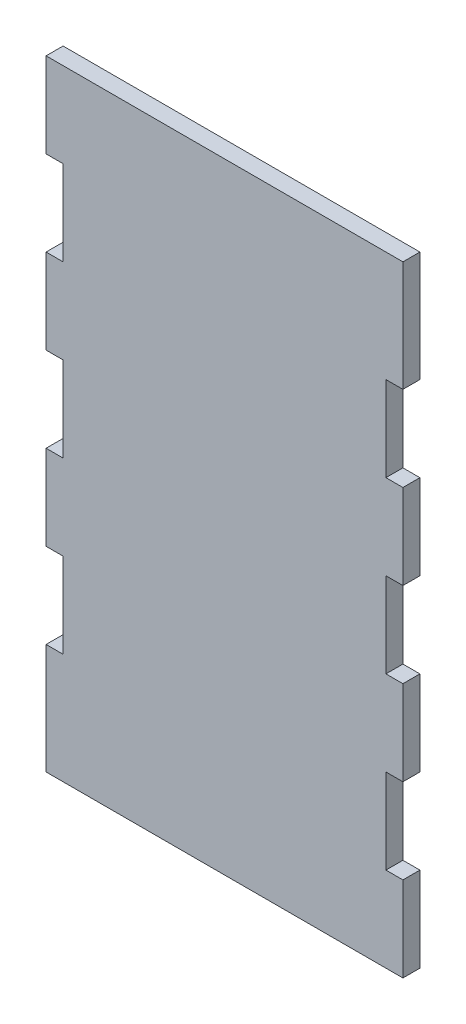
ISO-10303-21;
HEADER;
FILE_DESCRIPTION(('STEP AP214'),'2;1');
FILE_NAME('part.step','',(''),(''),'','','');
FILE_SCHEMA(('AUTOMOTIVE_DESIGN { 1 0 10303 214 1 1 1 1 }'));
ENDSEC;
DATA;
#1=APPLICATION_CONTEXT('core data for automotive mechanical design processes');
#2=APPLICATION_PROTOCOL_DEFINITION('international standard','automotive_design',2000,#1);
#3=PRODUCT_CONTEXT('',#1,'mechanical');
#4=PRODUCT('Part','Part','',(#3));
#5=PRODUCT_RELATED_PRODUCT_CATEGORY('part','',(#4));
#6=PRODUCT_DEFINITION_FORMATION('','',#4);
#7=PRODUCT_DEFINITION_CONTEXT('part definition',#1,'design');
#8=PRODUCT_DEFINITION('design','',#6,#7);
#9=PRODUCT_DEFINITION_SHAPE('','',#8);
#10=(LENGTH_UNIT() NAMED_UNIT(*) SI_UNIT(.MILLI.,.METRE.));
#11=(NAMED_UNIT(*) PLANE_ANGLE_UNIT() SI_UNIT($,.RADIAN.));
#12=(NAMED_UNIT(*) SI_UNIT($,.STERADIAN.) SOLID_ANGLE_UNIT());
#13=UNCERTAINTY_MEASURE_WITH_UNIT(LENGTH_MEASURE(1.E-05),#10,'distance_accuracy_value','');
#14=(GEOMETRIC_REPRESENTATION_CONTEXT(3) GLOBAL_UNCERTAINTY_ASSIGNED_CONTEXT((#13)) GLOBAL_UNIT_ASSIGNED_CONTEXT((#10,
#11,#12)) REPRESENTATION_CONTEXT('',''));
#15=CARTESIAN_POINT('',(0.,0.,0.));
#16=DIRECTION('',(0.,0.,1.));
#17=DIRECTION('',(1.,0.,0.));
#18=AXIS2_PLACEMENT_3D('',#15,#16,#17);
#19=CARTESIAN_POINT('',(-12.,-4.,2.));
#20=DIRECTION('',(1.,0.,0.));
#21=DIRECTION('',(0.,0.,-1.));
#22=AXIS2_PLACEMENT_3D('',#19,#20,#21);
#23=PLANE('',#22);
#24=DIRECTION('',(0.,0.,-1.));
#25=VECTOR('',#24,1.);
#26=CARTESIAN_POINT('',(-12.,59.,2.00000000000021));
#27=LINE('',#26,#25);
#28=CARTESIAN_POINT('',(-12.,59.,2.00000000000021));
#29=VERTEX_POINT('',#28);
#30=CARTESIAN_POINT('',(-12.,59.,2.0803461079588E-13));
#31=VERTEX_POINT('',#30);
#32=EDGE_CURVE('E361',#29,#31,#27,.T.);
#33=ORIENTED_EDGE('',*,*,#32,.F.);
#34=DIRECTION('',(0.,-1.,0.));
#35=VECTOR('',#34,1.);
#36=CARTESIAN_POINT('',(-12.,-4.,2.));
#37=LINE('',#36,#35);
#38=CARTESIAN_POINT('',(-12.,69.,2.));
#39=VERTEX_POINT('',#38);
#40=EDGE_CURVE('E365',#39,#29,#37,.T.);
#41=ORIENTED_EDGE('',*,*,#40,.F.);
#42=DIRECTION('',(0.,0.,-1.));
#43=VECTOR('',#42,1.);
#44=CARTESIAN_POINT('',(-12.,69.,2.));
#45=LINE('',#44,#43);
#46=CARTESIAN_POINT('',(-12.,69.,0.));
#47=VERTEX_POINT('',#46);
#48=EDGE_CURVE('E379',#39,#47,#45,.T.);
#49=ORIENTED_EDGE('',*,*,#48,.T.);
#50=DIRECTION('',(0.,-1.,0.));
#51=VECTOR('',#50,1.);
#52=CARTESIAN_POINT('',(-12.,-4.,0.));
#53=LINE('',#52,#51);
#54=EDGE_CURVE('E380',#47,#31,#53,.T.);
#55=ORIENTED_EDGE('',*,*,#54,.T.);
#56=EDGE_LOOP('',(#33,#41,#49,#55));
#57=FACE_BOUND('',#56,.T.);
#58=ADVANCED_FACE('F35',(#57),#23,.F.);
#59=DIRECTION('',(0.,0.,-1.));
#60=VECTOR('',#59,1.);
#61=CARTESIAN_POINT('',(-12.,49.,2.00000000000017));
#62=LINE('',#61,#60);
#63=CARTESIAN_POINT('',(-12.,49.,2.00000000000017));
#64=VERTEX_POINT('',#63);
#65=CARTESIAN_POINT('',(-12.,49.,1.73119797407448E-13));
#66=VERTEX_POINT('',#65);
#67=EDGE_CURVE('E358',#64,#66,#62,.T.);
#68=ORIENTED_EDGE('',*,*,#67,.T.);
#69=CARTESIAN_POINT('',(-12.,39.,1.38204984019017E-13));
#70=VERTEX_POINT('',#69);
#71=EDGE_CURVE('E384',#66,#70,#53,.T.);
#72=ORIENTED_EDGE('',*,*,#71,.T.);
#73=DIRECTION('',(0.,0.,-1.));
#74=VECTOR('',#73,1.);
#75=CARTESIAN_POINT('',(-12.,39.,2.00000000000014));
#76=LINE('',#75,#74);
#77=CARTESIAN_POINT('',(-12.,39.,2.00000000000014));
#78=VERTEX_POINT('',#77);
#79=EDGE_CURVE('E340',#78,#70,#76,.T.);
#80=ORIENTED_EDGE('',*,*,#79,.F.);
#81=EDGE_CURVE('E369',#64,#78,#37,.T.);
#82=ORIENTED_EDGE('',*,*,#81,.F.);
#83=EDGE_LOOP('',(#68,#72,#80,#82));
#84=FACE_BOUND('',#83,.T.);
#85=ADVANCED_FACE('F462',(#84),#23,.F.);
#86=DIRECTION('',(0.,0.,-1.));
#87=VECTOR('',#86,1.);
#88=CARTESIAN_POINT('',(-12.,29.,2.0000000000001));
#89=LINE('',#88,#87);
#90=CARTESIAN_POINT('',(-12.,29.,2.0000000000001));
#91=VERTEX_POINT('',#90);
#92=CARTESIAN_POINT('',(-12.,29.,1.03290170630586E-13));
#93=VERTEX_POINT('',#92);
#94=EDGE_CURVE('E337',#91,#93,#89,.T.);
#95=ORIENTED_EDGE('',*,*,#94,.T.);
#96=CARTESIAN_POINT('',(-12.,19.,0.));
#97=VERTEX_POINT('',#96);
#98=EDGE_CURVE('E483',#93,#97,#53,.T.);
#99=ORIENTED_EDGE('',*,*,#98,.T.);
#100=DIRECTION('',(0.,0.,-1.));
#101=VECTOR('',#100,1.);
#102=CARTESIAN_POINT('',(-12.,19.,2.00000000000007));
#103=LINE('',#102,#101);
#104=CARTESIAN_POINT('',(-12.,19.,2.00000000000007));
#105=VERTEX_POINT('',#104);
#106=EDGE_CURVE('E319',#105,#97,#103,.T.);
#107=ORIENTED_EDGE('',*,*,#106,.F.);
#108=EDGE_CURVE('E465',#91,#105,#37,.T.);
#109=ORIENTED_EDGE('',*,*,#108,.F.);
#110=EDGE_LOOP('',(#95,#99,#107,#109));
#111=FACE_BOUND('',#110,.T.);
#112=ADVANCED_FACE('F505',(#111),#23,.F.);
#113=DIRECTION('',(0.,0.,-1.));
#114=VECTOR('',#113,1.);
#115=CARTESIAN_POINT('',(-12.,8.99999999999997,2.00000000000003));
#116=LINE('',#115,#114);
#117=CARTESIAN_POINT('',(-12.,8.99999999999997,2.00000000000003));
#118=VERTEX_POINT('',#117);
#119=CARTESIAN_POINT('',(-12.,8.99999999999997,0.));
#120=VERTEX_POINT('',#119);
#121=EDGE_CURVE('E316',#118,#120,#116,.T.);
#122=ORIENTED_EDGE('',*,*,#121,.T.);
#123=CARTESIAN_POINT('',(-12.,-4.,0.));
#124=VERTEX_POINT('',#123);
#125=EDGE_CURVE('E301',#120,#124,#53,.T.);
#126=ORIENTED_EDGE('',*,*,#125,.T.);
#127=DIRECTION('',(0.,0.,-1.));
#128=VECTOR('',#127,1.);
#129=CARTESIAN_POINT('',(-12.,-4.,2.));
#130=LINE('',#129,#128);
#131=CARTESIAN_POINT('',(-12.,-4.,2.));
#132=VERTEX_POINT('',#131);
#133=EDGE_CURVE('E401',#132,#124,#130,.T.);
#134=ORIENTED_EDGE('',*,*,#133,.F.);
#135=EDGE_CURVE('E370',#118,#132,#37,.T.);
#136=ORIENTED_EDGE('',*,*,#135,.F.);
#137=EDGE_LOOP('',(#122,#126,#134,#136));
#138=FACE_BOUND('',#137,.T.);
#139=ADVANCED_FACE('F480',(#138),#23,.F.);
#140=CARTESIAN_POINT('',(30.,-4.,2.));
#141=DIRECTION('',(-1.,0.,0.));
#142=DIRECTION('',(0.,0.,1.));
#143=AXIS2_PLACEMENT_3D('',#140,#141,#142);
#144=PLANE('',#143);
#145=DIRECTION('',(0.,0.,-1.));
#146=VECTOR('',#145,1.);
#147=CARTESIAN_POINT('',(30.,6.,2.));
#148=LINE('',#147,#146);
#149=CARTESIAN_POINT('',(30.,6.,2.));
#150=VERTEX_POINT('',#149);
#151=CARTESIAN_POINT('',(30.,6.,0.));
#152=VERTEX_POINT('',#151);
#153=EDGE_CURVE('E296',#150,#152,#148,.T.);
#154=ORIENTED_EDGE('',*,*,#153,.F.);
#155=DIRECTION('',(0.,1.,0.));
#156=VECTOR('',#155,1.);
#157=CARTESIAN_POINT('',(30.,-4.,2.));
#158=LINE('',#157,#156);
#159=CARTESIAN_POINT('',(30.,-4.,2.));
#160=VERTEX_POINT('',#159);
#161=EDGE_CURVE('E373',#160,#150,#158,.T.);
#162=ORIENTED_EDGE('',*,*,#161,.F.);
#163=DIRECTION('',(0.,0.,-1.));
#164=VECTOR('',#163,1.);
#165=CARTESIAN_POINT('',(30.,-4.,2.));
#166=LINE('',#165,#164);
#167=CARTESIAN_POINT('',(30.,-4.,0.));
#168=VERTEX_POINT('',#167);
#169=EDGE_CURVE('E398',#160,#168,#166,.T.);
#170=ORIENTED_EDGE('',*,*,#169,.T.);
#171=DIRECTION('',(0.,1.,0.));
#172=VECTOR('',#171,1.);
#173=CARTESIAN_POINT('',(30.,-4.,0.));
#174=LINE('',#173,#172);
#175=EDGE_CURVE('E387',#168,#152,#174,.T.);
#176=ORIENTED_EDGE('',*,*,#175,.T.);
#177=EDGE_LOOP('',(#154,#162,#170,#176));
#178=FACE_BOUND('',#177,.T.);
#179=ADVANCED_FACE('F487',(#178),#144,.F.);
#180=DIRECTION('',(0.,0.,-1.));
#181=VECTOR('',#180,1.);
#182=CARTESIAN_POINT('',(30.,16.,2.));
#183=LINE('',#182,#181);
#184=CARTESIAN_POINT('',(30.,16.,2.));
#185=VERTEX_POINT('',#184);
#186=CARTESIAN_POINT('',(30.,16.,0.));
#187=VERTEX_POINT('',#186);
#188=EDGE_CURVE('E293',#185,#187,#183,.T.);
#189=ORIENTED_EDGE('',*,*,#188,.T.);
#190=CARTESIAN_POINT('',(30.,26.,0.));
#191=VERTEX_POINT('',#190);
#192=EDGE_CURVE('E391',#187,#191,#174,.T.);
#193=ORIENTED_EDGE('',*,*,#192,.T.);
#194=DIRECTION('',(0.,0.,-1.));
#195=VECTOR('',#194,1.);
#196=CARTESIAN_POINT('',(30.,26.,2.));
#197=LINE('',#196,#195);
#198=CARTESIAN_POINT('',(30.,26.,2.));
#199=VERTEX_POINT('',#198);
#200=EDGE_CURVE('E276',#199,#191,#197,.T.);
#201=ORIENTED_EDGE('',*,*,#200,.F.);
#202=EDGE_CURVE('E377',#185,#199,#158,.T.);
#203=ORIENTED_EDGE('',*,*,#202,.F.);
#204=EDGE_LOOP('',(#189,#193,#201,#203));
#205=FACE_BOUND('',#204,.T.);
#206=ADVANCED_FACE('F430',(#205),#144,.F.);
#207=DIRECTION('',(0.,0.,-1.));
#208=VECTOR('',#207,1.);
#209=CARTESIAN_POINT('',(30.,36.,2.));
#210=LINE('',#209,#208);
#211=CARTESIAN_POINT('',(30.,36.,2.));
#212=VERTEX_POINT('',#211);
#213=CARTESIAN_POINT('',(30.,36.,0.));
#214=VERTEX_POINT('',#213);
#215=EDGE_CURVE('E273',#212,#214,#210,.T.);
#216=ORIENTED_EDGE('',*,*,#215,.T.);
#217=CARTESIAN_POINT('',(30.,46.,0.));
#218=VERTEX_POINT('',#217);
#219=EDGE_CURVE('E768',#214,#218,#174,.T.);
#220=ORIENTED_EDGE('',*,*,#219,.T.);
#221=DIRECTION('',(0.,0.,-1.));
#222=VECTOR('',#221,1.);
#223=CARTESIAN_POINT('',(30.,46.,2.));
#224=LINE('',#223,#222);
#225=CARTESIAN_POINT('',(30.,46.,2.));
#226=VERTEX_POINT('',#225);
#227=EDGE_CURVE('E240',#226,#218,#224,.T.);
#228=ORIENTED_EDGE('',*,*,#227,.F.);
#229=EDGE_CURVE('E247',#212,#226,#158,.T.);
#230=ORIENTED_EDGE('',*,*,#229,.F.);
#231=EDGE_LOOP('',(#216,#220,#228,#230));
#232=FACE_BOUND('',#231,.T.);
#233=ADVANCED_FACE('F767',(#232),#144,.F.);
#234=DIRECTION('',(0.,0.,-1.));
#235=VECTOR('',#234,1.);
#236=CARTESIAN_POINT('',(30.,56.,2.));
#237=LINE('',#236,#235);
#238=CARTESIAN_POINT('',(30.,56.,2.));
#239=VERTEX_POINT('',#238);
#240=CARTESIAN_POINT('',(30.,56.,0.));
#241=VERTEX_POINT('',#240);
#242=EDGE_CURVE('E257',#239,#241,#237,.T.);
#243=ORIENTED_EDGE('',*,*,#242,.T.);
#244=CARTESIAN_POINT('',(30.,69.,0.));
#245=VERTEX_POINT('',#244);
#246=EDGE_CURVE('E386',#241,#245,#174,.T.);
#247=ORIENTED_EDGE('',*,*,#246,.T.);
#248=DIRECTION('',(0.,0.,-1.));
#249=VECTOR('',#248,1.);
#250=CARTESIAN_POINT('',(30.,69.,2.));
#251=LINE('',#250,#249);
#252=CARTESIAN_POINT('',(30.,69.,2.));
#253=VERTEX_POINT('',#252);
#254=EDGE_CURVE('E395',#253,#245,#251,.T.);
#255=ORIENTED_EDGE('',*,*,#254,.F.);
#256=EDGE_CURVE('E372',#239,#253,#158,.T.);
#257=ORIENTED_EDGE('',*,*,#256,.F.);
#258=EDGE_LOOP('',(#243,#247,#255,#257));
#259=FACE_BOUND('',#258,.T.);
#260=ADVANCED_FACE('F438',(#259),#144,.F.);
#261=CARTESIAN_POINT('',(0.,0.,2.));
#262=DIRECTION('',(0.,0.,-1.));
#263=DIRECTION('',(-1.,0.,0.));
#264=AXIS2_PLACEMENT_3D('',#261,#262,#263);
#265=PLANE('',#264);
#266=DIRECTION('',(1.,0.,0.));
#267=VECTOR('',#266,1.);
#268=CARTESIAN_POINT('',(28.,6.,2.));
#269=LINE('',#268,#267);
#270=CARTESIAN_POINT('',(28.,6.,2.));
#271=VERTEX_POINT('',#270);
#272=EDGE_CURVE('E283',#271,#150,#269,.T.);
#273=ORIENTED_EDGE('',*,*,#272,.F.);
#274=DIRECTION('',(0.,-1.,0.));
#275=VECTOR('',#274,1.);
#276=CARTESIAN_POINT('',(28.,6.,2.));
#277=LINE('',#276,#275);
#278=CARTESIAN_POINT('',(28.,16.,2.));
#279=VERTEX_POINT('',#278);
#280=EDGE_CURVE('E281',#279,#271,#277,.T.);
#281=ORIENTED_EDGE('',*,*,#280,.F.);
#282=DIRECTION('',(-1.,0.,0.));
#283=VECTOR('',#282,1.);
#284=CARTESIAN_POINT('',(28.,16.,2.));
#285=LINE('',#284,#283);
#286=EDGE_CURVE('E286',#185,#279,#285,.T.);
#287=ORIENTED_EDGE('',*,*,#286,.F.);
#288=ORIENTED_EDGE('',*,*,#202,.T.);
#289=DIRECTION('',(1.,0.,0.));
#290=VECTOR('',#289,1.);
#291=CARTESIAN_POINT('',(28.,26.,2.));
#292=LINE('',#291,#290);
#293=CARTESIAN_POINT('',(28.,26.,2.));
#294=VERTEX_POINT('',#293);
#295=EDGE_CURVE('E263',#294,#199,#292,.T.);
#296=ORIENTED_EDGE('',*,*,#295,.F.);
#297=DIRECTION('',(0.,-1.,0.));
#298=VECTOR('',#297,1.);
#299=CARTESIAN_POINT('',(28.,26.,2.));
#300=LINE('',#299,#298);
#301=CARTESIAN_POINT('',(28.,36.,2.));
#302=VERTEX_POINT('',#301);
#303=EDGE_CURVE('E261',#302,#294,#300,.T.);
#304=ORIENTED_EDGE('',*,*,#303,.F.);
#305=DIRECTION('',(-1.,0.,0.));
#306=VECTOR('',#305,1.);
#307=CARTESIAN_POINT('',(28.,36.,2.));
#308=LINE('',#307,#306);
#309=EDGE_CURVE('E266',#212,#302,#308,.T.);
#310=ORIENTED_EDGE('',*,*,#309,.F.);
#311=ORIENTED_EDGE('',*,*,#229,.T.);
#312=DIRECTION('',(1.,0.,0.));
#313=VECTOR('',#312,1.);
#314=CARTESIAN_POINT('',(28.,46.,2.));
#315=LINE('',#314,#313);
#316=CARTESIAN_POINT('',(28.,46.,2.));
#317=VERTEX_POINT('',#316);
#318=EDGE_CURVE('E230',#317,#226,#315,.T.);
#319=ORIENTED_EDGE('',*,*,#318,.F.);
#320=DIRECTION('',(0.,-1.,0.));
#321=VECTOR('',#320,1.);
#322=CARTESIAN_POINT('',(28.,46.,2.));
#323=LINE('',#322,#321);
#324=CARTESIAN_POINT('',(28.,56.,2.));
#325=VERTEX_POINT('',#324);
#326=EDGE_CURVE('E220',#325,#317,#323,.T.);
#327=ORIENTED_EDGE('',*,*,#326,.F.);
#328=DIRECTION('',(-1.,0.,0.));
#329=VECTOR('',#328,1.);
#330=CARTESIAN_POINT('',(28.,56.,2.));
#331=LINE('',#330,#329);
#332=EDGE_CURVE('E248',#239,#325,#331,.T.);
#333=ORIENTED_EDGE('',*,*,#332,.F.);
#334=ORIENTED_EDGE('',*,*,#256,.T.);
#335=DIRECTION('',(-1.,0.,0.));
#336=VECTOR('',#335,1.);
#337=CARTESIAN_POINT('',(-12.,69.,2.));
#338=LINE('',#337,#336);
#339=EDGE_CURVE('E376',#253,#39,#338,.T.);
#340=ORIENTED_EDGE('',*,*,#339,.T.);
#341=ORIENTED_EDGE('',*,*,#40,.T.);
#342=DIRECTION('',(-1.,0.,0.));
#343=VECTOR('',#342,1.);
#344=CARTESIAN_POINT('',(-10.,59.,2.00000000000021));
#345=LINE('',#344,#343);
#346=CARTESIAN_POINT('',(-10.,59.,2.00000000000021));
#347=VERTEX_POINT('',#346);
#348=EDGE_CURVE('E347',#347,#29,#345,.T.);
#349=ORIENTED_EDGE('',*,*,#348,.F.);
#350=DIRECTION('',(0.,1.,0.));
#351=VECTOR('',#350,1.);
#352=CARTESIAN_POINT('',(-10.,59.,2.00000000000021));
#353=LINE('',#352,#351);
#354=CARTESIAN_POINT('',(-10.,49.,2.00000000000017));
#355=VERTEX_POINT('',#354);
#356=EDGE_CURVE('E345',#355,#347,#353,.T.);
#357=ORIENTED_EDGE('',*,*,#356,.F.);
#358=DIRECTION('',(1.,0.,0.));
#359=VECTOR('',#358,1.);
#360=CARTESIAN_POINT('',(-10.,49.,2.00000000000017));
#361=LINE('',#360,#359);
#362=EDGE_CURVE('E350',#64,#355,#361,.T.);
#363=ORIENTED_EDGE('',*,*,#362,.F.);
#364=ORIENTED_EDGE('',*,*,#81,.T.);
#365=DIRECTION('',(-1.,0.,0.));
#366=VECTOR('',#365,1.);
#367=CARTESIAN_POINT('',(-10.,39.,2.00000000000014));
#368=LINE('',#367,#366);
#369=CARTESIAN_POINT('',(-10.,39.,2.00000000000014));
#370=VERTEX_POINT('',#369);
#371=EDGE_CURVE('E326',#370,#78,#368,.T.);
#372=ORIENTED_EDGE('',*,*,#371,.F.);
#373=DIRECTION('',(0.,1.,0.));
#374=VECTOR('',#373,1.);
#375=CARTESIAN_POINT('',(-10.,39.,2.00000000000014));
#376=LINE('',#375,#374);
#377=CARTESIAN_POINT('',(-10.,29.,2.0000000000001));
#378=VERTEX_POINT('',#377);
#379=EDGE_CURVE('E324',#378,#370,#376,.T.);
#380=ORIENTED_EDGE('',*,*,#379,.F.);
#381=DIRECTION('',(1.,0.,0.));
#382=VECTOR('',#381,1.);
#383=CARTESIAN_POINT('',(-10.,29.,2.0000000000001));
#384=LINE('',#383,#382);
#385=EDGE_CURVE('E329',#91,#378,#384,.T.);
#386=ORIENTED_EDGE('',*,*,#385,.F.);
#387=ORIENTED_EDGE('',*,*,#108,.T.);
#388=DIRECTION('',(-1.,0.,0.));
#389=VECTOR('',#388,1.);
#390=CARTESIAN_POINT('',(-10.,19.,2.00000000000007));
#391=LINE('',#390,#389);
#392=CARTESIAN_POINT('',(-10.,19.,2.00000000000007));
#393=VERTEX_POINT('',#392);
#394=EDGE_CURVE('E304',#393,#105,#391,.T.);
#395=ORIENTED_EDGE('',*,*,#394,.F.);
#396=DIRECTION('',(0.,1.,0.));
#397=VECTOR('',#396,1.);
#398=CARTESIAN_POINT('',(-10.,19.,2.00000000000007));
#399=LINE('',#398,#397);
#400=CARTESIAN_POINT('',(-10.,8.99999999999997,2.00000000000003));
#401=VERTEX_POINT('',#400);
#402=EDGE_CURVE('E302',#401,#393,#399,.T.);
#403=ORIENTED_EDGE('',*,*,#402,.F.);
#404=DIRECTION('',(1.,0.,0.));
#405=VECTOR('',#404,1.);
#406=CARTESIAN_POINT('',(-10.,8.99999999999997,2.00000000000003));
#407=LINE('',#406,#405);
#408=EDGE_CURVE('E307',#118,#401,#407,.T.);
#409=ORIENTED_EDGE('',*,*,#408,.F.);
#410=ORIENTED_EDGE('',*,*,#135,.T.);
#411=DIRECTION('',(1.,0.,0.));
#412=VECTOR('',#411,1.);
#413=CARTESIAN_POINT('',(-12.,-4.,2.));
#414=LINE('',#413,#412);
#415=EDGE_CURVE('E368',#132,#160,#414,.T.);
#416=ORIENTED_EDGE('',*,*,#415,.T.);
#417=ORIENTED_EDGE('',*,*,#161,.T.);
#418=EDGE_LOOP('',(#273,#281,#287,#288,#296,#304,#310,#311,#319,#327,#333,#334,#340,#341,#349,
#357,#363,#364,#372,#380,#386,#387,#395,#403,#409,#410,#416,#417));
#419=FACE_BOUND('',#418,.T.);
#420=ADVANCED_FACE('F244',(#419),#265,.F.);
#421=CARTESIAN_POINT('',(0.,0.,0.));
#422=DIRECTION('',(0.,0.,-1.));
#423=DIRECTION('',(-1.,0.,0.));
#424=AXIS2_PLACEMENT_3D('',#421,#422,#423);
#425=PLANE('',#424);
#426=ORIENTED_EDGE('',*,*,#54,.F.);
#427=DIRECTION('',(-1.,0.,0.));
#428=VECTOR('',#427,1.);
#429=CARTESIAN_POINT('',(-12.,69.,0.));
#430=LINE('',#429,#428);
#431=EDGE_CURVE('E390',#245,#47,#430,.T.);
#432=ORIENTED_EDGE('',*,*,#431,.F.);
#433=ORIENTED_EDGE('',*,*,#246,.F.);
#434=DIRECTION('',(-1.,0.,0.));
#435=VECTOR('',#434,1.);
#436=CARTESIAN_POINT('',(28.,56.,0.));
#437=LINE('',#436,#435);
#438=CARTESIAN_POINT('',(28.,56.,0.));
#439=VERTEX_POINT('',#438);
#440=EDGE_CURVE('E231',#241,#439,#437,.T.);
#441=ORIENTED_EDGE('',*,*,#440,.T.);
#442=DIRECTION('',(0.,-1.,0.));
#443=VECTOR('',#442,1.);
#444=CARTESIAN_POINT('',(28.,0.,0.));
#445=LINE('',#444,#443);
#446=CARTESIAN_POINT('',(28.,46.,0.));
#447=VERTEX_POINT('',#446);
#448=EDGE_CURVE('E38',#439,#447,#445,.T.);
#449=ORIENTED_EDGE('',*,*,#448,.T.);
#450=DIRECTION('',(1.,0.,0.));
#451=VECTOR('',#450,1.);
#452=CARTESIAN_POINT('',(28.,46.,0.));
#453=LINE('',#452,#451);
#454=EDGE_CURVE('E237',#447,#218,#453,.T.);
#455=ORIENTED_EDGE('',*,*,#454,.T.);
#456=ORIENTED_EDGE('',*,*,#219,.F.);
#457=DIRECTION('',(-1.,0.,0.));
#458=VECTOR('',#457,1.);
#459=CARTESIAN_POINT('',(28.,36.,0.));
#460=LINE('',#459,#458);
#461=CARTESIAN_POINT('',(28.,36.,0.));
#462=VERTEX_POINT('',#461);
#463=EDGE_CURVE('E264',#214,#462,#460,.T.);
#464=ORIENTED_EDGE('',*,*,#463,.T.);
#465=CARTESIAN_POINT('',(28.,26.,0.));
#466=VERTEX_POINT('',#465);
#467=EDGE_CURVE('E43',#462,#466,#445,.T.);
#468=ORIENTED_EDGE('',*,*,#467,.T.);
#469=DIRECTION('',(1.,0.,0.));
#470=VECTOR('',#469,1.);
#471=CARTESIAN_POINT('',(28.,26.,0.));
#472=LINE('',#471,#470);
#473=EDGE_CURVE('E239',#466,#191,#472,.T.);
#474=ORIENTED_EDGE('',*,*,#473,.T.);
#475=ORIENTED_EDGE('',*,*,#192,.F.);
#476=DIRECTION('',(-1.,0.,0.));
#477=VECTOR('',#476,1.);
#478=CARTESIAN_POINT('',(28.,16.,0.));
#479=LINE('',#478,#477);
#480=CARTESIAN_POINT('',(28.,16.,0.));
#481=VERTEX_POINT('',#480);
#482=EDGE_CURVE('E284',#187,#481,#479,.T.);
#483=ORIENTED_EDGE('',*,*,#482,.T.);
#484=CARTESIAN_POINT('',(28.,6.,0.));
#485=VERTEX_POINT('',#484);
#486=EDGE_CURVE('E11',#481,#485,#445,.T.);
#487=ORIENTED_EDGE('',*,*,#486,.T.);
#488=DIRECTION('',(1.,0.,0.));
#489=VECTOR('',#488,1.);
#490=CARTESIAN_POINT('',(28.,6.,0.));
#491=LINE('',#490,#489);
#492=EDGE_CURVE('E280',#485,#152,#491,.T.);
#493=ORIENTED_EDGE('',*,*,#492,.T.);
#494=ORIENTED_EDGE('',*,*,#175,.F.);
#495=DIRECTION('',(1.,0.,0.));
#496=VECTOR('',#495,1.);
#497=CARTESIAN_POINT('',(-12.,-4.,0.));
#498=LINE('',#497,#496);
#499=EDGE_CURVE('E383',#124,#168,#498,.T.);
#500=ORIENTED_EDGE('',*,*,#499,.F.);
#501=ORIENTED_EDGE('',*,*,#125,.F.);
#502=DIRECTION('',(1.,0.,0.));
#503=VECTOR('',#502,1.);
#504=CARTESIAN_POINT('',(-10.,8.99999999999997,0.));
#505=LINE('',#504,#503);
#506=CARTESIAN_POINT('',(-10.,8.99999999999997,0.));
#507=VERTEX_POINT('',#506);
#508=EDGE_CURVE('E305',#120,#507,#505,.T.);
#509=ORIENTED_EDGE('',*,*,#508,.T.);
#510=DIRECTION('',(0.,1.,0.));
#511=VECTOR('',#510,1.);
#512=CARTESIAN_POINT('',(-10.,0.,0.));
#513=LINE('',#512,#511);
#514=CARTESIAN_POINT('',(-10.,19.,0.));
#515=VERTEX_POINT('',#514);
#516=EDGE_CURVE('E403',#507,#515,#513,.T.);
#517=ORIENTED_EDGE('',*,*,#516,.T.);
#518=DIRECTION('',(-1.,0.,0.));
#519=VECTOR('',#518,1.);
#520=CARTESIAN_POINT('',(-10.,19.,0.));
#521=LINE('',#520,#519);
#522=EDGE_CURVE('E310',#515,#97,#521,.T.);
#523=ORIENTED_EDGE('',*,*,#522,.T.);
#524=ORIENTED_EDGE('',*,*,#98,.F.);
#525=DIRECTION('',(1.,0.,0.));
#526=VECTOR('',#525,1.);
#527=CARTESIAN_POINT('',(-10.,29.,1.03290170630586E-13));
#528=LINE('',#527,#526);
#529=CARTESIAN_POINT('',(-10.,29.,0.));
#530=VERTEX_POINT('',#529);
#531=EDGE_CURVE('E327',#93,#530,#528,.T.);
#532=ORIENTED_EDGE('',*,*,#531,.T.);
#533=CARTESIAN_POINT('',(-10.,39.,1.38204984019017E-13));
#534=VERTEX_POINT('',#533);
#535=EDGE_CURVE('E405',#530,#534,#513,.T.);
#536=ORIENTED_EDGE('',*,*,#535,.T.);
#537=DIRECTION('',(-1.,0.,0.));
#538=VECTOR('',#537,1.);
#539=CARTESIAN_POINT('',(-10.,39.,1.38204984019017E-13));
#540=LINE('',#539,#538);
#541=EDGE_CURVE('E323',#534,#70,#540,.T.);
#542=ORIENTED_EDGE('',*,*,#541,.T.);
#543=ORIENTED_EDGE('',*,*,#71,.F.);
#544=DIRECTION('',(1.,0.,0.));
#545=VECTOR('',#544,1.);
#546=CARTESIAN_POINT('',(-10.,49.,1.73119797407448E-13));
#547=LINE('',#546,#545);
#548=CARTESIAN_POINT('',(-10.,49.,0.));
#549=VERTEX_POINT('',#548);
#550=EDGE_CURVE('E348',#66,#549,#547,.T.);
#551=ORIENTED_EDGE('',*,*,#550,.T.);
#552=CARTESIAN_POINT('',(-10.,59.,2.0803461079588E-13));
#553=VERTEX_POINT('',#552);
#554=EDGE_CURVE('E406',#549,#553,#513,.T.);
#555=ORIENTED_EDGE('',*,*,#554,.T.);
#556=DIRECTION('',(-1.,0.,0.));
#557=VECTOR('',#556,1.);
#558=CARTESIAN_POINT('',(-10.,59.,2.0803461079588E-13));
#559=LINE('',#558,#557);
#560=EDGE_CURVE('E344',#553,#31,#559,.T.);
#561=ORIENTED_EDGE('',*,*,#560,.T.);
#562=EDGE_LOOP('',(#426,#432,#433,#441,#449,#455,#456,#464,#468,#474,#475,#483,#487,#493,#494,
#500,#501,#509,#517,#523,#524,#532,#536,#542,#543,#551,#555,#561));
#563=FACE_BOUND('',#562,.T.);
#564=ADVANCED_FACE('F414',(#563),#425,.T.);
#565=CARTESIAN_POINT('',(-12.,-4.,2.));
#566=DIRECTION('',(0.,1.,0.));
#567=DIRECTION('',(0.,0.,1.));
#568=AXIS2_PLACEMENT_3D('',#565,#566,#567);
#569=PLANE('',#568);
#570=ORIENTED_EDGE('',*,*,#499,.T.);
#571=ORIENTED_EDGE('',*,*,#169,.F.);
#572=ORIENTED_EDGE('',*,*,#415,.F.);
#573=ORIENTED_EDGE('',*,*,#133,.T.);
#574=EDGE_LOOP('',(#570,#571,#572,#573));
#575=FACE_BOUND('',#574,.T.);
#576=ADVANCED_FACE('F478',(#575),#569,.F.);
#577=CARTESIAN_POINT('',(-12.,69.,2.));
#578=DIRECTION('',(0.,-1.,0.));
#579=DIRECTION('',(0.,0.,-1.));
#580=AXIS2_PLACEMENT_3D('',#577,#578,#579);
#581=PLANE('',#580);
#582=ORIENTED_EDGE('',*,*,#431,.T.);
#583=ORIENTED_EDGE('',*,*,#48,.F.);
#584=ORIENTED_EDGE('',*,*,#339,.F.);
#585=ORIENTED_EDGE('',*,*,#254,.T.);
#586=EDGE_LOOP('',(#582,#583,#584,#585));
#587=FACE_BOUND('',#586,.T.);
#588=ADVANCED_FACE('F442',(#587),#581,.F.);
#589=CARTESIAN_POINT('',(-10.,19.,2.00000000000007));
#590=DIRECTION('',(0.,-1.,0.));
#591=DIRECTION('',(0.,0.,-1.));
#592=AXIS2_PLACEMENT_3D('',#589,#590,#591);
#593=PLANE('',#592);
#594=ORIENTED_EDGE('',*,*,#522,.F.);
#595=DIRECTION('',(0.,0.,-1.));
#596=VECTOR('',#595,1.);
#597=CARTESIAN_POINT('',(-10.,19.,2.00000000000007));
#598=LINE('',#597,#596);
#599=EDGE_CURVE('E321',#393,#515,#598,.T.);
#600=ORIENTED_EDGE('',*,*,#599,.F.);
#601=ORIENTED_EDGE('',*,*,#394,.T.);
#602=ORIENTED_EDGE('',*,*,#106,.T.);
#603=EDGE_LOOP('',(#594,#600,#601,#602));
#604=FACE_BOUND('',#603,.T.);
#605=ADVANCED_FACE('F540',(#604),#593,.T.);
#606=CARTESIAN_POINT('',(-10.,8.99999999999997,2.00000000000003));
#607=DIRECTION('',(0.,1.,0.));
#608=DIRECTION('',(0.,0.,1.));
#609=AXIS2_PLACEMENT_3D('',#606,#607,#608);
#610=PLANE('',#609);
#611=ORIENTED_EDGE('',*,*,#508,.F.);
#612=ORIENTED_EDGE('',*,*,#121,.F.);
#613=ORIENTED_EDGE('',*,*,#408,.T.);
#614=DIRECTION('',(0.,0.,-1.));
#615=VECTOR('',#614,1.);
#616=CARTESIAN_POINT('',(-10.,8.99999999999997,2.00000000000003));
#617=LINE('',#616,#615);
#618=EDGE_CURVE('E309',#401,#507,#617,.T.);
#619=ORIENTED_EDGE('',*,*,#618,.T.);
#620=EDGE_LOOP('',(#611,#612,#613,#619));
#621=FACE_BOUND('',#620,.T.);
#622=ADVANCED_FACE('F569',(#621),#610,.T.);
#623=CARTESIAN_POINT('',(-10.,69.0000000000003,-93.0273921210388));
#624=DIRECTION('',(-1.,0.,0.));
#625=DIRECTION('',(0.,0.,-1.));
#626=AXIS2_PLACEMENT_3D('',#623,#624,#625);
#627=PLANE('',#626);
#628=ORIENTED_EDGE('',*,*,#618,.F.);
#629=ORIENTED_EDGE('',*,*,#402,.T.);
#630=ORIENTED_EDGE('',*,*,#599,.T.);
#631=ORIENTED_EDGE('',*,*,#516,.F.);
#632=EDGE_LOOP('',(#628,#629,#630,#631));
#633=FACE_BOUND('',#632,.T.);
#634=ADVANCED_FACE('F537',(#633),#627,.T.);
#635=CARTESIAN_POINT('',(-10.,39.,2.00000000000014));
#636=DIRECTION('',(0.,-1.,0.));
#637=DIRECTION('',(0.,0.,-1.));
#638=AXIS2_PLACEMENT_3D('',#635,#636,#637);
#639=PLANE('',#638);
#640=ORIENTED_EDGE('',*,*,#541,.F.);
#641=DIRECTION('',(0.,0.,-1.));
#642=VECTOR('',#641,1.);
#643=CARTESIAN_POINT('',(-10.,39.,2.00000000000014));
#644=LINE('',#643,#642);
#645=EDGE_CURVE('E342',#370,#534,#644,.T.);
#646=ORIENTED_EDGE('',*,*,#645,.F.);
#647=ORIENTED_EDGE('',*,*,#371,.T.);
#648=ORIENTED_EDGE('',*,*,#79,.T.);
#649=EDGE_LOOP('',(#640,#646,#647,#648));
#650=FACE_BOUND('',#649,.T.);
#651=ADVANCED_FACE('F524',(#650),#639,.T.);
#652=CARTESIAN_POINT('',(-10.,29.,2.0000000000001));
#653=DIRECTION('',(0.,1.,0.));
#654=DIRECTION('',(0.,0.,1.));
#655=AXIS2_PLACEMENT_3D('',#652,#653,#654);
#656=PLANE('',#655);
#657=ORIENTED_EDGE('',*,*,#531,.F.);
#658=ORIENTED_EDGE('',*,*,#94,.F.);
#659=ORIENTED_EDGE('',*,*,#385,.T.);
#660=DIRECTION('',(0.,0.,-1.));
#661=VECTOR('',#660,1.);
#662=CARTESIAN_POINT('',(-10.,29.,2.0000000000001));
#663=LINE('',#662,#661);
#664=EDGE_CURVE('E331',#378,#530,#663,.T.);
#665=ORIENTED_EDGE('',*,*,#664,.T.);
#666=EDGE_LOOP('',(#657,#658,#659,#665));
#667=FACE_BOUND('',#666,.T.);
#668=ADVANCED_FACE('F529',(#667),#656,.T.);
#669=ORIENTED_EDGE('',*,*,#664,.F.);
#670=ORIENTED_EDGE('',*,*,#379,.T.);
#671=ORIENTED_EDGE('',*,*,#645,.T.);
#672=ORIENTED_EDGE('',*,*,#535,.F.);
#673=EDGE_LOOP('',(#669,#670,#671,#672));
#674=FACE_BOUND('',#673,.T.);
#675=ADVANCED_FACE('F528',(#674),#627,.T.);
#676=DIRECTION('',(0.,0.,-1.));
#677=VECTOR('',#676,1.);
#678=CARTESIAN_POINT('',(-10.,49.,2.00000000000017));
#679=LINE('',#678,#677);
#680=EDGE_CURVE('E352',#355,#549,#679,.T.);
#681=ORIENTED_EDGE('',*,*,#680,.F.);
#682=ORIENTED_EDGE('',*,*,#356,.T.);
#683=DIRECTION('',(0.,0.,-1.));
#684=VECTOR('',#683,1.);
#685=CARTESIAN_POINT('',(-10.,59.,2.00000000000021));
#686=LINE('',#685,#684);
#687=EDGE_CURVE('E253',#347,#553,#686,.T.);
#688=ORIENTED_EDGE('',*,*,#687,.T.);
#689=ORIENTED_EDGE('',*,*,#554,.F.);
#690=EDGE_LOOP('',(#681,#682,#688,#689));
#691=FACE_BOUND('',#690,.T.);
#692=ADVANCED_FACE('F454',(#691),#627,.T.);
#693=CARTESIAN_POINT('',(-10.,59.,2.00000000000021));
#694=DIRECTION('',(0.,-1.,0.));
#695=DIRECTION('',(0.,0.,-1.));
#696=AXIS2_PLACEMENT_3D('',#693,#694,#695);
#697=PLANE('',#696);
#698=ORIENTED_EDGE('',*,*,#560,.F.);
#699=ORIENTED_EDGE('',*,*,#687,.F.);
#700=ORIENTED_EDGE('',*,*,#348,.T.);
#701=ORIENTED_EDGE('',*,*,#32,.T.);
#702=EDGE_LOOP('',(#698,#699,#700,#701));
#703=FACE_BOUND('',#702,.T.);
#704=ADVANCED_FACE('F451',(#703),#697,.T.);
#705=CARTESIAN_POINT('',(-10.,49.,2.00000000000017));
#706=DIRECTION('',(0.,1.,0.));
#707=DIRECTION('',(0.,0.,1.));
#708=AXIS2_PLACEMENT_3D('',#705,#706,#707);
#709=PLANE('',#708);
#710=ORIENTED_EDGE('',*,*,#550,.F.);
#711=ORIENTED_EDGE('',*,*,#67,.F.);
#712=ORIENTED_EDGE('',*,*,#362,.T.);
#713=ORIENTED_EDGE('',*,*,#680,.T.);
#714=EDGE_LOOP('',(#710,#711,#712,#713));
#715=FACE_BOUND('',#714,.T.);
#716=ADVANCED_FACE('F456',(#715),#709,.T.);
#717=CARTESIAN_POINT('',(28.,46.,2.));
#718=DIRECTION('',(0.,1.,0.));
#719=DIRECTION('',(0.,0.,-1.));
#720=AXIS2_PLACEMENT_3D('',#717,#718,#719);
#721=PLANE('',#720);
#722=ORIENTED_EDGE('',*,*,#454,.F.);
#723=DIRECTION('',(0.,0.,-1.));
#724=VECTOR('',#723,1.);
#725=CARTESIAN_POINT('',(28.,46.,2.));
#726=LINE('',#725,#724);
#727=EDGE_CURVE('E224',#317,#447,#726,.T.);
#728=ORIENTED_EDGE('',*,*,#727,.F.);
#729=ORIENTED_EDGE('',*,*,#318,.T.);
#730=ORIENTED_EDGE('',*,*,#227,.T.);
#731=EDGE_LOOP('',(#722,#728,#729,#730));
#732=FACE_BOUND('',#731,.T.);
#733=ADVANCED_FACE('F234',(#732),#721,.T.);
#734=CARTESIAN_POINT('',(28.,56.,2.));
#735=DIRECTION('',(0.,-1.,0.));
#736=DIRECTION('',(0.,0.,1.));
#737=AXIS2_PLACEMENT_3D('',#734,#735,#736);
#738=PLANE('',#737);
#739=ORIENTED_EDGE('',*,*,#440,.F.);
#740=ORIENTED_EDGE('',*,*,#242,.F.);
#741=ORIENTED_EDGE('',*,*,#332,.T.);
#742=DIRECTION('',(0.,0.,-1.));
#743=VECTOR('',#742,1.);
#744=CARTESIAN_POINT('',(28.,56.,2.));
#745=LINE('',#744,#743);
#746=EDGE_CURVE('E226',#325,#439,#745,.T.);
#747=ORIENTED_EDGE('',*,*,#746,.T.);
#748=EDGE_LOOP('',(#739,#740,#741,#747));
#749=FACE_BOUND('',#748,.T.);
#750=ADVANCED_FACE('F659',(#749),#738,.T.);
#751=CARTESIAN_POINT('',(28.,-4.,-93.0273921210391));
#752=DIRECTION('',(1.,0.,0.));
#753=DIRECTION('',(0.,0.,-1.));
#754=AXIS2_PLACEMENT_3D('',#751,#752,#753);
#755=PLANE('',#754);
#756=ORIENTED_EDGE('',*,*,#746,.F.);
#757=ORIENTED_EDGE('',*,*,#326,.T.);
#758=ORIENTED_EDGE('',*,*,#727,.T.);
#759=ORIENTED_EDGE('',*,*,#448,.F.);
#760=EDGE_LOOP('',(#756,#757,#758,#759));
#761=FACE_BOUND('',#760,.T.);
#762=ADVANCED_FACE('F222',(#761),#755,.T.);
#763=CARTESIAN_POINT('',(28.,26.,2.));
#764=DIRECTION('',(0.,1.,0.));
#765=DIRECTION('',(0.,0.,-1.));
#766=AXIS2_PLACEMENT_3D('',#763,#764,#765);
#767=PLANE('',#766);
#768=ORIENTED_EDGE('',*,*,#473,.F.);
#769=DIRECTION('',(0.,0.,-1.));
#770=VECTOR('',#769,1.);
#771=CARTESIAN_POINT('',(28.,26.,2.));
#772=LINE('',#771,#770);
#773=EDGE_CURVE('E278',#294,#466,#772,.T.);
#774=ORIENTED_EDGE('',*,*,#773,.F.);
#775=ORIENTED_EDGE('',*,*,#295,.T.);
#776=ORIENTED_EDGE('',*,*,#200,.T.);
#777=EDGE_LOOP('',(#768,#774,#775,#776));
#778=FACE_BOUND('',#777,.T.);
#779=ADVANCED_FACE('F425',(#778),#767,.T.);
#780=CARTESIAN_POINT('',(28.,36.,2.));
#781=DIRECTION('',(0.,-1.,0.));
#782=DIRECTION('',(0.,0.,1.));
#783=AXIS2_PLACEMENT_3D('',#780,#781,#782);
#784=PLANE('',#783);
#785=ORIENTED_EDGE('',*,*,#463,.F.);
#786=ORIENTED_EDGE('',*,*,#215,.F.);
#787=ORIENTED_EDGE('',*,*,#309,.T.);
#788=DIRECTION('',(0.,0.,-1.));
#789=VECTOR('',#788,1.);
#790=CARTESIAN_POINT('',(28.,36.,2.));
#791=LINE('',#790,#789);
#792=EDGE_CURVE('E58',#302,#462,#791,.T.);
#793=ORIENTED_EDGE('',*,*,#792,.T.);
#794=EDGE_LOOP('',(#785,#786,#787,#793));
#795=FACE_BOUND('',#794,.T.);
#796=ADVANCED_FACE('F703',(#795),#784,.T.);
#797=ORIENTED_EDGE('',*,*,#792,.F.);
#798=ORIENTED_EDGE('',*,*,#303,.T.);
#799=ORIENTED_EDGE('',*,*,#773,.T.);
#800=ORIENTED_EDGE('',*,*,#467,.F.);
#801=EDGE_LOOP('',(#797,#798,#799,#800));
#802=FACE_BOUND('',#801,.T.);
#803=ADVANCED_FACE('F420',(#802),#755,.T.);
#804=DIRECTION('',(0.,0.,-1.));
#805=VECTOR('',#804,1.);
#806=CARTESIAN_POINT('',(28.,16.,2.));
#807=LINE('',#806,#805);
#808=EDGE_CURVE('E50',#279,#481,#807,.T.);
#809=ORIENTED_EDGE('',*,*,#808,.F.);
#810=ORIENTED_EDGE('',*,*,#280,.T.);
#811=DIRECTION('',(0.,0.,-1.));
#812=VECTOR('',#811,1.);
#813=CARTESIAN_POINT('',(28.,6.,2.));
#814=LINE('',#813,#812);
#815=EDGE_CURVE('E298',#271,#485,#814,.T.);
#816=ORIENTED_EDGE('',*,*,#815,.T.);
#817=ORIENTED_EDGE('',*,*,#486,.F.);
#818=EDGE_LOOP('',(#809,#810,#816,#817));
#819=FACE_BOUND('',#818,.T.);
#820=ADVANCED_FACE('F492',(#819),#755,.T.);
#821=CARTESIAN_POINT('',(28.,6.,2.));
#822=DIRECTION('',(0.,1.,0.));
#823=DIRECTION('',(0.,0.,-1.));
#824=AXIS2_PLACEMENT_3D('',#821,#822,#823);
#825=PLANE('',#824);
#826=ORIENTED_EDGE('',*,*,#492,.F.);
#827=ORIENTED_EDGE('',*,*,#815,.F.);
#828=ORIENTED_EDGE('',*,*,#272,.T.);
#829=ORIENTED_EDGE('',*,*,#153,.T.);
#830=EDGE_LOOP('',(#826,#827,#828,#829));
#831=FACE_BOUND('',#830,.T.);
#832=ADVANCED_FACE('F490',(#831),#825,.T.);
#833=CARTESIAN_POINT('',(28.,16.,2.));
#834=DIRECTION('',(0.,-1.,0.));
#835=DIRECTION('',(0.,0.,1.));
#836=AXIS2_PLACEMENT_3D('',#833,#834,#835);
#837=PLANE('',#836);
#838=ORIENTED_EDGE('',*,*,#482,.F.);
#839=ORIENTED_EDGE('',*,*,#188,.F.);
#840=ORIENTED_EDGE('',*,*,#286,.T.);
#841=ORIENTED_EDGE('',*,*,#808,.T.);
#842=EDGE_LOOP('',(#838,#839,#840,#841));
#843=FACE_BOUND('',#842,.T.);
#844=ADVANCED_FACE('F493',(#843),#837,.T.);
#845=CLOSED_SHELL('',(#58,#85,#112,#139,#179,#206,#233,#260,#420,#564,#576,#588,#605,#622,#634,
#651,#668,#675,#692,#704,#716,#733,#750,#762,#779,#796,#803,#820,#832,#844));
#846=MANIFOLD_SOLID_BREP('B2',#845);
#847=ADVANCED_BREP_SHAPE_REPRESENTATION('',(#18,#846),#14);
#848=SHAPE_DEFINITION_REPRESENTATION(#9,#847);
ENDSEC;
END-ISO-10303-21;
